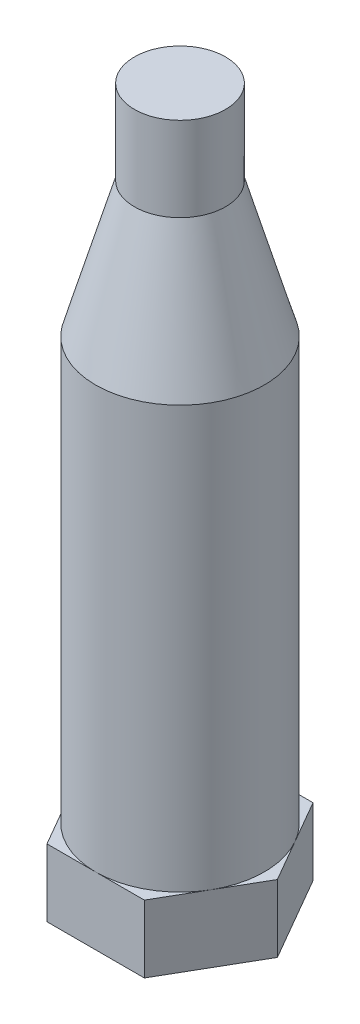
ISO-10303-21;
HEADER;
FILE_DESCRIPTION(('STEP AP214'),'2;1');
FILE_NAME('part.step','',(''),(''),'','','');
FILE_SCHEMA(('AUTOMOTIVE_DESIGN { 1 0 10303 214 1 1 1 1 }'));
ENDSEC;
DATA;
#1=APPLICATION_CONTEXT('core data for automotive mechanical design processes');
#2=APPLICATION_PROTOCOL_DEFINITION('international standard','automotive_design',2000,#1);
#3=PRODUCT_CONTEXT('',#1,'mechanical');
#4=PRODUCT('Part','Part','',(#3));
#5=PRODUCT_RELATED_PRODUCT_CATEGORY('part','',(#4));
#6=PRODUCT_DEFINITION_FORMATION('','',#4);
#7=PRODUCT_DEFINITION_CONTEXT('part definition',#1,'design');
#8=PRODUCT_DEFINITION('design','',#6,#7);
#9=PRODUCT_DEFINITION_SHAPE('','',#8);
#10=(LENGTH_UNIT() NAMED_UNIT(*) SI_UNIT(.MILLI.,.METRE.));
#11=(NAMED_UNIT(*) PLANE_ANGLE_UNIT() SI_UNIT($,.RADIAN.));
#12=(NAMED_UNIT(*) SI_UNIT($,.STERADIAN.) SOLID_ANGLE_UNIT());
#13=UNCERTAINTY_MEASURE_WITH_UNIT(LENGTH_MEASURE(1.E-05),#10,'distance_accuracy_value','');
#14=(GEOMETRIC_REPRESENTATION_CONTEXT(3) GLOBAL_UNCERTAINTY_ASSIGNED_CONTEXT((#13)) GLOBAL_UNIT_ASSIGNED_CONTEXT((#10,
#11,#12)) REPRESENTATION_CONTEXT('',''));
#15=CARTESIAN_POINT('',(0.,0.,0.));
#16=DIRECTION('',(0.,0.,1.));
#17=DIRECTION('',(1.,0.,0.));
#18=AXIS2_PLACEMENT_3D('',#15,#16,#17);
#19=CARTESIAN_POINT('',(-7.33234841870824,5.08,-12.7));
#20=DIRECTION('',(0.,-1.,0.));
#21=DIRECTION('',(0.,0.,-1.));
#22=AXIS2_PLACEMENT_3D('',#19,#20,#21);
#23=PLANE('',#22);
#24=CARTESIAN_POINT('',(3.66617420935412,5.08,-6.35));
#25=DIRECTION('',(0.,1.,0.));
#26=DIRECTION('',(0.,0.,1.));
#27=AXIS2_PLACEMENT_3D('',#24,#25,#26);
#28=CIRCLE('',#27,6.35);
#29=CARTESIAN_POINT('',(3.66617420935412,5.08,0.));
#30=VERTEX_POINT('',#29);
#31=CARTESIAN_POINT('',(9.16543552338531,5.08,-3.175));
#32=VERTEX_POINT('',#31);
#33=EDGE_CURVE('E42',#30,#32,#28,.T.);
#34=ORIENTED_EDGE('',*,*,#33,.F.);
#35=DIRECTION('',(1.,0.,0.));
#36=VECTOR('',#35,1.);
#37=CARTESIAN_POINT('',(0.,5.08,0.));
#38=LINE('',#37,#36);
#39=CARTESIAN_POINT('',(7.33234841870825,5.08,0.));
#40=VERTEX_POINT('',#39);
#41=EDGE_CURVE('E117',#30,#40,#38,.T.);
#42=ORIENTED_EDGE('',*,*,#41,.T.);
#43=DIRECTION('',(0.5,0.,-0.866025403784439));
#44=VECTOR('',#43,1.);
#45=CARTESIAN_POINT('',(7.33234841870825,5.08,0.));
#46=LINE('',#45,#44);
#47=EDGE_CURVE('E129',#40,#32,#46,.T.);
#48=ORIENTED_EDGE('',*,*,#47,.T.);
#49=EDGE_LOOP('',(#34,#42,#48));
#50=FACE_BOUND('',#49,.T.);
#51=ADVANCED_FACE('F31',(#50),#23,.F.);
#52=CARTESIAN_POINT('',(9.16543552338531,5.08,-9.525));
#53=VERTEX_POINT('',#52);
#54=EDGE_CURVE('E11',#32,#53,#28,.T.);
#55=ORIENTED_EDGE('',*,*,#54,.F.);
#56=CARTESIAN_POINT('',(10.9985226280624,5.08,-6.35));
#57=VERTEX_POINT('',#56);
#58=EDGE_CURVE('E116',#32,#57,#46,.T.);
#59=ORIENTED_EDGE('',*,*,#58,.T.);
#60=DIRECTION('',(-0.5,0.,-0.866025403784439));
#61=VECTOR('',#60,1.);
#62=CARTESIAN_POINT('',(10.9985226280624,5.08,-6.35));
#63=LINE('',#62,#61);
#64=EDGE_CURVE('E140',#57,#53,#63,.T.);
#65=ORIENTED_EDGE('',*,*,#64,.T.);
#66=EDGE_LOOP('',(#55,#59,#65));
#67=FACE_BOUND('',#66,.T.);
#68=ADVANCED_FACE('F198',(#67),#23,.F.);
#69=CARTESIAN_POINT('',(3.66617420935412,5.08,-12.7));
#70=VERTEX_POINT('',#69);
#71=EDGE_CURVE('E40',#53,#70,#28,.T.);
#72=ORIENTED_EDGE('',*,*,#71,.F.);
#73=CARTESIAN_POINT('',(7.33234841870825,5.08,-12.7));
#74=VERTEX_POINT('',#73);
#75=EDGE_CURVE('E139',#53,#74,#63,.T.);
#76=ORIENTED_EDGE('',*,*,#75,.T.);
#77=DIRECTION('',(-1.,0.,0.));
#78=VECTOR('',#77,1.);
#79=CARTESIAN_POINT('',(7.33234841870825,5.08,-12.7));
#80=LINE('',#79,#78);
#81=EDGE_CURVE('E144',#74,#70,#80,.T.);
#82=ORIENTED_EDGE('',*,*,#81,.T.);
#83=EDGE_LOOP('',(#72,#76,#82));
#84=FACE_BOUND('',#83,.T.);
#85=ADVANCED_FACE('F196',(#84),#23,.F.);
#86=CARTESIAN_POINT('',(-1.83308710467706,5.08,-9.525));
#87=VERTEX_POINT('',#86);
#88=EDGE_CURVE('E57',#70,#87,#28,.T.);
#89=ORIENTED_EDGE('',*,*,#88,.F.);
#90=CARTESIAN_POINT('',(0.,5.08,-12.7));
#91=VERTEX_POINT('',#90);
#92=EDGE_CURVE('E143',#70,#91,#80,.T.);
#93=ORIENTED_EDGE('',*,*,#92,.T.);
#94=DIRECTION('',(-0.5,0.,0.866025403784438));
#95=VECTOR('',#94,1.);
#96=CARTESIAN_POINT('',(0.,5.08,-12.7));
#97=LINE('',#96,#95);
#98=EDGE_CURVE('E148',#91,#87,#97,.T.);
#99=ORIENTED_EDGE('',*,*,#98,.T.);
#100=EDGE_LOOP('',(#89,#93,#99));
#101=FACE_BOUND('',#100,.T.);
#102=ADVANCED_FACE('F205',(#101),#23,.F.);
#103=CARTESIAN_POINT('',(-1.83308710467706,5.08,-3.175));
#104=VERTEX_POINT('',#103);
#105=EDGE_CURVE('E49',#87,#104,#28,.T.);
#106=ORIENTED_EDGE('',*,*,#105,.F.);
#107=CARTESIAN_POINT('',(-3.66617420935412,5.08,-6.35));
#108=VERTEX_POINT('',#107);
#109=EDGE_CURVE('E147',#87,#108,#97,.T.);
#110=ORIENTED_EDGE('',*,*,#109,.T.);
#111=DIRECTION('',(0.5,0.,0.866025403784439));
#112=VECTOR('',#111,1.);
#113=CARTESIAN_POINT('',(-3.66617420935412,5.08,-6.35));
#114=LINE('',#113,#112);
#115=EDGE_CURVE('E127',#108,#104,#114,.T.);
#116=ORIENTED_EDGE('',*,*,#115,.T.);
#117=EDGE_LOOP('',(#106,#110,#116));
#118=FACE_BOUND('',#117,.T.);
#119=ADVANCED_FACE('F228',(#118),#23,.F.);
#120=EDGE_CURVE('E110',#104,#30,#28,.T.);
#121=ORIENTED_EDGE('',*,*,#120,.F.);
#122=CARTESIAN_POINT('',(0.,5.08,0.));
#123=VERTEX_POINT('',#122);
#124=EDGE_CURVE('E112',#104,#123,#114,.T.);
#125=ORIENTED_EDGE('',*,*,#124,.T.);
#126=EDGE_CURVE('E106',#123,#30,#38,.T.);
#127=ORIENTED_EDGE('',*,*,#126,.T.);
#128=EDGE_LOOP('',(#121,#125,#127));
#129=FACE_BOUND('',#128,.T.);
#130=ADVANCED_FACE('F108',(#129),#23,.F.);
#131=CARTESIAN_POINT('',(-3.66617420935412,5.08,-6.35));
#132=DIRECTION('',(0.866025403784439,0.,-0.5));
#133=DIRECTION('',(-0.5,0.,-0.866025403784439));
#134=AXIS2_PLACEMENT_3D('',#131,#132,#133);
#135=PLANE('',#134);
#136=DIRECTION('',(0.5,0.,0.866025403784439));
#137=VECTOR('',#136,1.);
#138=CARTESIAN_POINT('',(-3.66617420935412,0.,-6.35));
#139=LINE('',#138,#137);
#140=CARTESIAN_POINT('',(-3.66617420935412,0.,-6.35));
#141=VERTEX_POINT('',#140);
#142=CARTESIAN_POINT('',(0.,0.,0.));
#143=VERTEX_POINT('',#142);
#144=EDGE_CURVE('E151',#141,#143,#139,.T.);
#145=ORIENTED_EDGE('',*,*,#144,.T.);
#146=DIRECTION('',(0.,-1.,0.));
#147=VECTOR('',#146,1.);
#148=CARTESIAN_POINT('',(0.,5.08,0.));
#149=LINE('',#148,#147);
#150=EDGE_CURVE('E35',#123,#143,#149,.T.);
#151=ORIENTED_EDGE('',*,*,#150,.F.);
#152=ORIENTED_EDGE('',*,*,#124,.F.);
#153=ORIENTED_EDGE('',*,*,#115,.F.);
#154=DIRECTION('',(0.,-1.,0.));
#155=VECTOR('',#154,1.);
#156=CARTESIAN_POINT('',(-3.66617420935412,5.08,-6.35));
#157=LINE('',#156,#155);
#158=EDGE_CURVE('E150',#108,#141,#157,.T.);
#159=ORIENTED_EDGE('',*,*,#158,.T.);
#160=EDGE_LOOP('',(#145,#151,#152,#153,#159));
#161=FACE_BOUND('',#160,.T.);
#162=ADVANCED_FACE('F33',(#161),#135,.F.);
#163=CARTESIAN_POINT('',(0.,5.08,0.));
#164=DIRECTION('',(0.,0.,-1.));
#165=DIRECTION('',(-1.,0.,0.));
#166=AXIS2_PLACEMENT_3D('',#163,#164,#165);
#167=PLANE('',#166);
#168=DIRECTION('',(1.,0.,0.));
#169=VECTOR('',#168,1.);
#170=CARTESIAN_POINT('',(0.,0.,0.));
#171=LINE('',#170,#169);
#172=CARTESIAN_POINT('',(7.33234841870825,0.,0.));
#173=VERTEX_POINT('',#172);
#174=EDGE_CURVE('E154',#143,#173,#171,.T.);
#175=ORIENTED_EDGE('',*,*,#174,.T.);
#176=DIRECTION('',(0.,-1.,0.));
#177=VECTOR('',#176,1.);
#178=CARTESIAN_POINT('',(7.33234841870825,5.08,0.));
#179=LINE('',#178,#177);
#180=EDGE_CURVE('E123',#40,#173,#179,.T.);
#181=ORIENTED_EDGE('',*,*,#180,.F.);
#182=ORIENTED_EDGE('',*,*,#41,.F.);
#183=ORIENTED_EDGE('',*,*,#126,.F.);
#184=ORIENTED_EDGE('',*,*,#150,.T.);
#185=EDGE_LOOP('',(#175,#181,#182,#183,#184));
#186=FACE_BOUND('',#185,.T.);
#187=ADVANCED_FACE('F121',(#186),#167,.F.);
#188=CARTESIAN_POINT('',(7.33234841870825,5.08,0.));
#189=DIRECTION('',(-0.866025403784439,0.,-0.5));
#190=DIRECTION('',(-0.5,0.,0.866025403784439));
#191=AXIS2_PLACEMENT_3D('',#188,#189,#190);
#192=PLANE('',#191);
#193=DIRECTION('',(0.5,0.,-0.866025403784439));
#194=VECTOR('',#193,1.);
#195=CARTESIAN_POINT('',(7.33234841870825,0.,0.));
#196=LINE('',#195,#194);
#197=CARTESIAN_POINT('',(10.9985226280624,0.,-6.35));
#198=VERTEX_POINT('',#197);
#199=EDGE_CURVE('E156',#173,#198,#196,.T.);
#200=ORIENTED_EDGE('',*,*,#199,.T.);
#201=DIRECTION('',(0.,-1.,0.));
#202=VECTOR('',#201,1.);
#203=CARTESIAN_POINT('',(10.9985226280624,5.08,-6.35));
#204=LINE('',#203,#202);
#205=EDGE_CURVE('E172',#57,#198,#204,.T.);
#206=ORIENTED_EDGE('',*,*,#205,.F.);
#207=ORIENTED_EDGE('',*,*,#58,.F.);
#208=ORIENTED_EDGE('',*,*,#47,.F.);
#209=ORIENTED_EDGE('',*,*,#180,.T.);
#210=EDGE_LOOP('',(#200,#206,#207,#208,#209));
#211=FACE_BOUND('',#210,.T.);
#212=ADVANCED_FACE('F176',(#211),#192,.F.);
#213=CARTESIAN_POINT('',(10.9985226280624,5.08,-6.35));
#214=DIRECTION('',(-0.866025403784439,0.,0.5));
#215=DIRECTION('',(0.5,0.,0.866025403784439));
#216=AXIS2_PLACEMENT_3D('',#213,#214,#215);
#217=PLANE('',#216);
#218=DIRECTION('',(-0.5,0.,-0.866025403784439));
#219=VECTOR('',#218,1.);
#220=CARTESIAN_POINT('',(10.9985226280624,0.,-6.35));
#221=LINE('',#220,#219);
#222=CARTESIAN_POINT('',(7.33234841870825,0.,-12.7));
#223=VERTEX_POINT('',#222);
#224=EDGE_CURVE('E158',#198,#223,#221,.T.);
#225=ORIENTED_EDGE('',*,*,#224,.T.);
#226=DIRECTION('',(0.,-1.,0.));
#227=VECTOR('',#226,1.);
#228=CARTESIAN_POINT('',(7.33234841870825,5.08,-12.7));
#229=LINE('',#228,#227);
#230=EDGE_CURVE('E169',#74,#223,#229,.T.);
#231=ORIENTED_EDGE('',*,*,#230,.F.);
#232=ORIENTED_EDGE('',*,*,#75,.F.);
#233=ORIENTED_EDGE('',*,*,#64,.F.);
#234=ORIENTED_EDGE('',*,*,#205,.T.);
#235=EDGE_LOOP('',(#225,#231,#232,#233,#234));
#236=FACE_BOUND('',#235,.T.);
#237=ADVANCED_FACE('F187',(#236),#217,.F.);
#238=CARTESIAN_POINT('',(7.33234841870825,5.08,-12.7));
#239=DIRECTION('',(0.,0.,1.));
#240=DIRECTION('',(1.,0.,0.));
#241=AXIS2_PLACEMENT_3D('',#238,#239,#240);
#242=PLANE('',#241);
#243=DIRECTION('',(-1.,0.,0.));
#244=VECTOR('',#243,1.);
#245=CARTESIAN_POINT('',(7.33234841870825,0.,-12.7));
#246=LINE('',#245,#244);
#247=CARTESIAN_POINT('',(0.,0.,-12.7));
#248=VERTEX_POINT('',#247);
#249=EDGE_CURVE('E160',#223,#248,#246,.T.);
#250=ORIENTED_EDGE('',*,*,#249,.T.);
#251=DIRECTION('',(0.,-1.,0.));
#252=VECTOR('',#251,1.);
#253=CARTESIAN_POINT('',(0.,5.08,-12.7));
#254=LINE('',#253,#252);
#255=EDGE_CURVE('E166',#91,#248,#254,.T.);
#256=ORIENTED_EDGE('',*,*,#255,.F.);
#257=ORIENTED_EDGE('',*,*,#92,.F.);
#258=ORIENTED_EDGE('',*,*,#81,.F.);
#259=ORIENTED_EDGE('',*,*,#230,.T.);
#260=EDGE_LOOP('',(#250,#256,#257,#258,#259));
#261=FACE_BOUND('',#260,.T.);
#262=ADVANCED_FACE('F192',(#261),#242,.F.);
#263=CARTESIAN_POINT('',(0.,5.08,-12.7));
#264=DIRECTION('',(0.866025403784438,0.,0.5));
#265=DIRECTION('',(0.5,0.,-0.866025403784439));
#266=AXIS2_PLACEMENT_3D('',#263,#264,#265);
#267=PLANE('',#266);
#268=DIRECTION('',(-0.5,0.,0.866025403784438));
#269=VECTOR('',#268,1.);
#270=CARTESIAN_POINT('',(0.,0.,-12.7));
#271=LINE('',#270,#269);
#272=EDGE_CURVE('E162',#248,#141,#271,.T.);
#273=ORIENTED_EDGE('',*,*,#272,.T.);
#274=ORIENTED_EDGE('',*,*,#158,.F.);
#275=ORIENTED_EDGE('',*,*,#109,.F.);
#276=ORIENTED_EDGE('',*,*,#98,.F.);
#277=ORIENTED_EDGE('',*,*,#255,.T.);
#278=EDGE_LOOP('',(#273,#274,#275,#276,#277));
#279=FACE_BOUND('',#278,.T.);
#280=ADVANCED_FACE('F211',(#279),#267,.F.);
#281=CARTESIAN_POINT('',(-7.33234841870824,0.,-12.7));
#282=DIRECTION('',(0.,-1.,0.));
#283=DIRECTION('',(0.,0.,-1.));
#284=AXIS2_PLACEMENT_3D('',#281,#282,#283);
#285=PLANE('',#284);
#286=ORIENTED_EDGE('',*,*,#144,.F.);
#287=ORIENTED_EDGE('',*,*,#272,.F.);
#288=ORIENTED_EDGE('',*,*,#249,.F.);
#289=ORIENTED_EDGE('',*,*,#224,.F.);
#290=ORIENTED_EDGE('',*,*,#199,.F.);
#291=ORIENTED_EDGE('',*,*,#174,.F.);
#292=EDGE_LOOP('',(#286,#287,#288,#289,#290,#291));
#293=FACE_BOUND('',#292,.T.);
#294=ADVANCED_FACE('F182',(#293),#285,.T.);
#295=CARTESIAN_POINT('',(3.66617420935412,36.83,-6.35));
#296=DIRECTION('',(0.,-1.,0.));
#297=DIRECTION('',(0.,0.,-1.));
#298=AXIS2_PLACEMENT_3D('',#295,#296,#297);
#299=CYLINDRICAL_SURFACE('',#298,6.35);
#300=CARTESIAN_POINT('',(3.66617420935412,36.83,-6.35));
#301=DIRECTION('',(0.,1.,0.));
#302=DIRECTION('',(0.,0.,1.));
#303=AXIS2_PLACEMENT_3D('',#300,#301,#302);
#304=CIRCLE('',#303,6.35);
#305=CARTESIAN_POINT('',(3.66617420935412,36.83,0.));
#306=VERTEX_POINT('',#305);
#307=EDGE_CURVE('E131',#306,#306,#304,.T.);
#308=ORIENTED_EDGE('',*,*,#307,.F.);
#309=EDGE_LOOP('',(#308));
#310=FACE_BOUND('',#309,.T.);
#311=ORIENTED_EDGE('',*,*,#33,.T.);
#312=ORIENTED_EDGE('',*,*,#54,.T.);
#313=ORIENTED_EDGE('',*,*,#71,.T.);
#314=ORIENTED_EDGE('',*,*,#88,.T.);
#315=ORIENTED_EDGE('',*,*,#105,.T.);
#316=ORIENTED_EDGE('',*,*,#120,.T.);
#317=EDGE_LOOP('',(#311,#312,#313,#314,#315,#316));
#318=FACE_BOUND('',#317,.T.);
#319=ADVANCED_FACE('F133',(#310,#318),#299,.T.);
#320=CARTESIAN_POINT('',(3.66617420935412,46.99,-6.35));
#321=DIRECTION('',(0.,-1.,0.));
#322=DIRECTION('',(0.,0.,-1.));
#323=AXIS2_PLACEMENT_3D('',#320,#321,#322);
#324=CONICAL_SURFACE('',#323,3.429,0.279949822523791);
#325=ORIENTED_EDGE('',*,*,#307,.T.);
#326=EDGE_LOOP('',(#325));
#327=FACE_BOUND('',#326,.T.);
#328=CARTESIAN_POINT('',(3.66617420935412,46.99,-6.35));
#329=DIRECTION('',(0.,-1.,0.));
#330=DIRECTION('',(0.,0.,-1.));
#331=AXIS2_PLACEMENT_3D('',#328,#329,#330);
#332=CIRCLE('',#331,3.429);
#333=CARTESIAN_POINT('',(3.66617420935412,46.99,-9.779));
#334=VERTEX_POINT('',#333);
#335=EDGE_CURVE('E132',#334,#334,#332,.T.);
#336=ORIENTED_EDGE('',*,*,#335,.T.);
#337=EDGE_LOOP('',(#336));
#338=FACE_BOUND('',#337,.T.);
#339=ADVANCED_FACE('F284',(#327,#338),#324,.T.);
#340=CARTESIAN_POINT('',(3.66617420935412,0.,-6.35));
#341=DIRECTION('',(0.,-1.,0.));
#342=DIRECTION('',(0.,0.,-1.));
#343=AXIS2_PLACEMENT_3D('',#340,#341,#342);
#344=CYLINDRICAL_SURFACE('',#343,3.429);
#345=ORIENTED_EDGE('',*,*,#335,.F.);
#346=EDGE_LOOP('',(#345));
#347=FACE_BOUND('',#346,.T.);
#348=CARTESIAN_POINT('',(3.66617420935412,53.34,-6.35));
#349=DIRECTION('',(0.,-1.,0.));
#350=DIRECTION('',(0.,0.,-1.));
#351=AXIS2_PLACEMENT_3D('',#348,#349,#350);
#352=CIRCLE('',#351,3.429);
#353=CARTESIAN_POINT('',(3.66617420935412,53.34,-9.779));
#354=VERTEX_POINT('',#353);
#355=EDGE_CURVE('E319',#354,#354,#352,.T.);
#356=ORIENTED_EDGE('',*,*,#355,.T.);
#357=EDGE_LOOP('',(#356));
#358=FACE_BOUND('',#357,.T.);
#359=ADVANCED_FACE('F294',(#347,#358),#344,.T.);
#360=CARTESIAN_POINT('',(7.09517420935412,53.34,-6.35));
#361=DIRECTION('',(0.,-1.,0.));
#362=DIRECTION('',(0.,0.,-1.));
#363=AXIS2_PLACEMENT_3D('',#360,#361,#362);
#364=PLANE('',#363);
#365=ORIENTED_EDGE('',*,*,#355,.F.);
#366=EDGE_LOOP('',(#365));
#367=FACE_BOUND('',#366,.T.);
#368=ADVANCED_FACE('F303',(#367),#364,.F.);
#369=CLOSED_SHELL('',(#51,#68,#85,#102,#119,#130,#162,#187,#212,#237,#262,#280,#294,#319,#339,
#359,#368));
#370=MANIFOLD_SOLID_BREP('B2',#369);
#371=ADVANCED_BREP_SHAPE_REPRESENTATION('',(#18,#370),#14);
#372=SHAPE_DEFINITION_REPRESENTATION(#9,#371);
ENDSEC;
END-ISO-10303-21;
